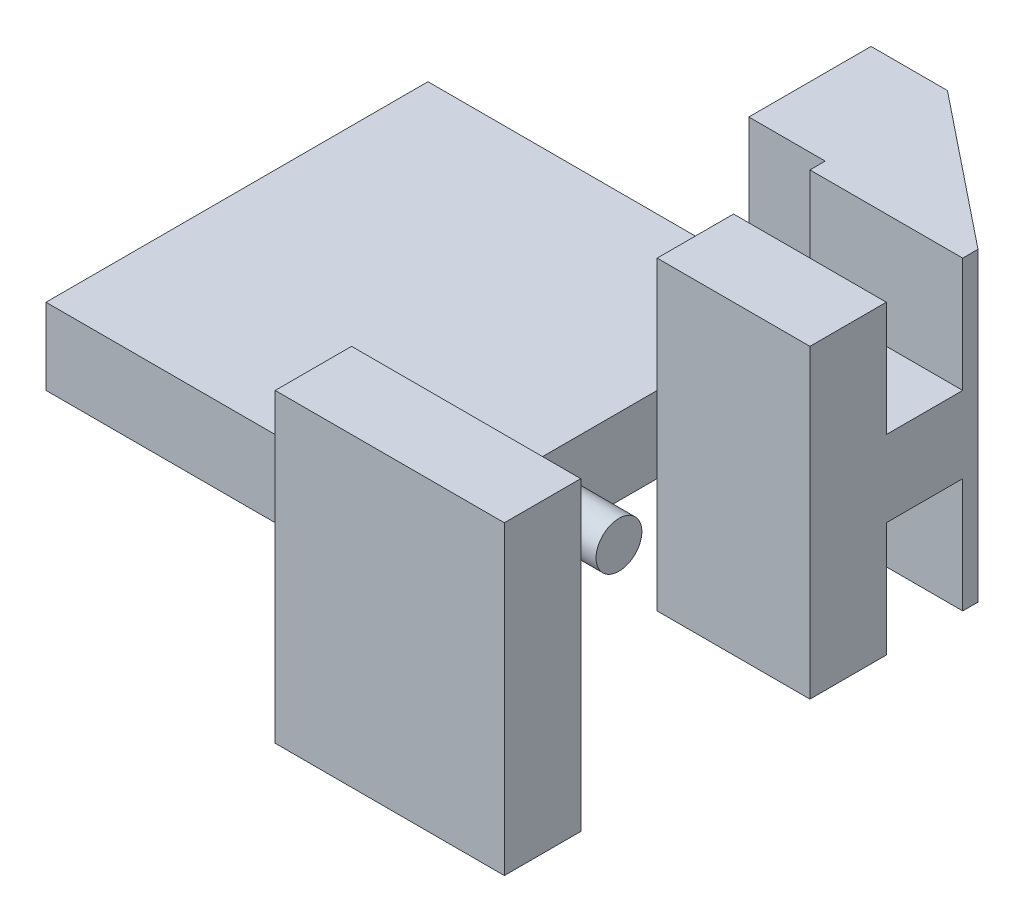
from build123d import *

# Parameters (mm, degrees)
BOSS_EXTRUDE1_DEPTH = 10
CUT_EXTRUDE1_REACH  = 39.779
SKETCH2_W           = 26
SKETCH2_H           = 7.5
SKETCH4_W           = 5
SKETCH4_H           = 7.5
CUT_EXTRUDE3_DEPTH  = 10
SKETCH5_R           = 1.5
BOSS_EXTRUDE3_DEPTH = 5


with BuildPart() as part:
    # Sketch1 → Boss-Extrude1 (new, symmetric)
    with BuildSketch(Plane(origin=(0, 0, 0), x_dir=(1, 0, 0), z_dir=(0, 1, 0))):
        Polygon((-25, 17.5), (-25, -7.5), (-5, -7.5), (-5, -12.5), (10, -12.5), (10, -7.5), (0, -7.5), (0, 0), (0, 7.5), (10, 7.5), (10, 18.5), (0, 26.5), (-5, 26.5), (-5, 17.5), align=None)
    extrude(amount=BOSS_EXTRUDE1_DEPTH, both=True)

    # Cut-Extrude1: up to this face of the body (flat: up to its plane)
    cut_extrude1_end = Plane(part.part.faces().sort_by_distance((-25, 0, -5))[0])
    # Sketch2 → Cut-Extrude1 (cut, up to the picked face)
    with BuildSketch(Plane(origin=(0, 0, 0), x_dir=(0, 0, -1), z_dir=(1, 0, 0)), mode=Mode.PRIVATE) as cut_extrude1_sk1:
        with Locations((5.5, -6.25)):
            Rectangle(SKETCH2_W, SKETCH2_H)
    cut_extrude1_tool1 = split(extrude(cut_extrude1_sk1.sketch, amount=-CUT_EXTRUDE1_REACH, mode=Mode.PRIVATE), bisect_by=cut_extrude1_end, keep=Keep.BOTH, mode=Mode.PRIVATE)
    # Sketch2 → Cut-Extrude1 (cut, up to the picked face)
    with BuildSketch(Plane(origin=(0, 0, 0), x_dir=(0, 0, -1), z_dir=(1, 0, 0)), mode=Mode.PRIVATE) as cut_extrude1_sk2:
        with Locations((5.5, 6.25)):
            Rectangle(SKETCH2_W, SKETCH2_H)
    cut_extrude1_tool2 = split(extrude(cut_extrude1_sk2.sketch, amount=-CUT_EXTRUDE1_REACH, mode=Mode.PRIVATE), bisect_by=cut_extrude1_end, keep=Keep.BOTH, mode=Mode.PRIVATE)
    add(cut_extrude1_tool1.solids().sort_by(Axis((0, -6.25, -5.5), (-1, 0, 0)))[0], mode=Mode.SUBTRACT)
    add(cut_extrude1_tool2.solids().sort_by(Axis((0, 6.25, -5.5), (-1, 0, 0)))[0], mode=Mode.SUBTRACT)

    # Sketch4 → Cut-Extrude3 (cut)
    with BuildSketch(Plane.ZY):
        with Locations((-15, 6.25)):
            Rectangle(SKETCH4_W, SKETCH4_H)
        with Locations((-15, -6.25)):
            Rectangle(SKETCH4_W, SKETCH4_H)
    extrude(amount=-CUT_EXTRUDE3_DEPTH, mode=Mode.SUBTRACT)

    # Sketch5 → Boss-Extrude3 (add)
    with BuildSketch(Plane(origin=(0, 0, 0), x_dir=(0, 0, -1), z_dir=(1, 0, 0))):
        with Locations(Location((0, 0, 0), (0, 0, 180))):
            Circle(SKETCH5_R)
    extrude(amount=BOSS_EXTRUDE3_DEPTH)


solid = part.part
